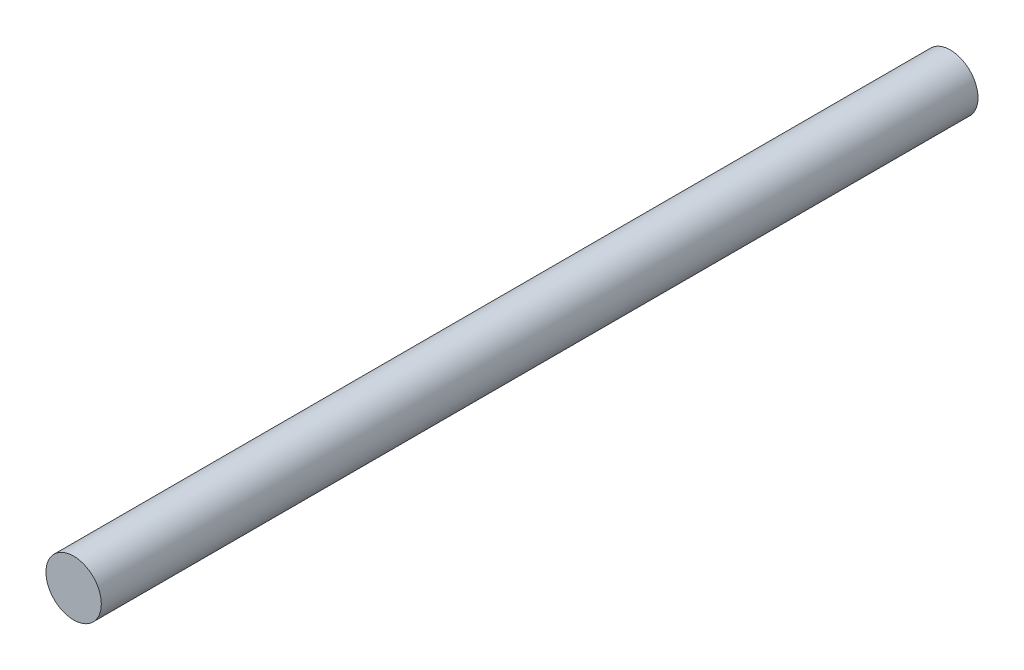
ISO-10303-21;
HEADER;
FILE_DESCRIPTION(('STEP AP214'),'2;1');
FILE_NAME('part.step','',(''),(''),'','','');
FILE_SCHEMA(('AUTOMOTIVE_DESIGN { 1 0 10303 214 1 1 1 1 }'));
ENDSEC;
DATA;
#1=APPLICATION_CONTEXT('core data for automotive mechanical design processes');
#2=APPLICATION_PROTOCOL_DEFINITION('international standard','automotive_design',2000,#1);
#3=PRODUCT_CONTEXT('',#1,'mechanical');
#4=PRODUCT('Part','Part','',(#3));
#5=PRODUCT_RELATED_PRODUCT_CATEGORY('part','',(#4));
#6=PRODUCT_DEFINITION_FORMATION('','',#4);
#7=PRODUCT_DEFINITION_CONTEXT('part definition',#1,'design');
#8=PRODUCT_DEFINITION('design','',#6,#7);
#9=PRODUCT_DEFINITION_SHAPE('','',#8);
#10=(LENGTH_UNIT() NAMED_UNIT(*) SI_UNIT(.MILLI.,.METRE.));
#11=(NAMED_UNIT(*) PLANE_ANGLE_UNIT() SI_UNIT($,.RADIAN.));
#12=(NAMED_UNIT(*) SI_UNIT($,.STERADIAN.) SOLID_ANGLE_UNIT());
#13=UNCERTAINTY_MEASURE_WITH_UNIT(LENGTH_MEASURE(1.E-05),#10,'distance_accuracy_value','');
#14=(GEOMETRIC_REPRESENTATION_CONTEXT(3) GLOBAL_UNCERTAINTY_ASSIGNED_CONTEXT((#13)) GLOBAL_UNIT_ASSIGNED_CONTEXT((#10,
#11,#12)) REPRESENTATION_CONTEXT('',''));
#15=CARTESIAN_POINT('',(0.,0.,0.));
#16=DIRECTION('',(0.,0.,1.));
#17=DIRECTION('',(1.,0.,0.));
#18=AXIS2_PLACEMENT_3D('',#15,#16,#17);
#19=CARTESIAN_POINT('',(0.,0.,95.));
#20=DIRECTION('',(0.,0.,-1.));
#21=DIRECTION('',(-1.,0.,0.));
#22=AXIS2_PLACEMENT_3D('',#19,#20,#21);
#23=CYLINDRICAL_SURFACE('',#22,3.);
#24=CARTESIAN_POINT('',(0.,0.,95.));
#25=DIRECTION('',(0.,0.,1.));
#26=DIRECTION('',(1.,0.,0.));
#27=AXIS2_PLACEMENT_3D('',#24,#25,#26);
#28=CIRCLE('',#27,3.);
#29=CARTESIAN_POINT('',(3.,0.,95.));
#30=VERTEX_POINT('',#29);
#31=EDGE_CURVE('E10',#30,#30,#28,.T.);
#32=ORIENTED_EDGE('',*,*,#31,.F.);
#33=EDGE_LOOP('',(#32));
#34=FACE_BOUND('',#33,.T.);
#35=CARTESIAN_POINT('',(0.,0.,0.));
#36=DIRECTION('',(0.,0.,1.));
#37=DIRECTION('',(1.,0.,0.));
#38=AXIS2_PLACEMENT_3D('',#35,#36,#37);
#39=CIRCLE('',#38,3.);
#40=CARTESIAN_POINT('',(3.,0.,0.));
#41=VERTEX_POINT('',#40);
#42=EDGE_CURVE('E32',#41,#41,#39,.T.);
#43=ORIENTED_EDGE('',*,*,#42,.T.);
#44=EDGE_LOOP('',(#43));
#45=FACE_BOUND('',#44,.T.);
#46=ADVANCED_FACE('F29',(#34,#45),#23,.T.);
#47=CARTESIAN_POINT('',(0.,0.,95.));
#48=DIRECTION('',(0.,0.,1.));
#49=DIRECTION('',(1.,0.,0.));
#50=AXIS2_PLACEMENT_3D('',#47,#48,#49);
#51=PLANE('',#50);
#52=ORIENTED_EDGE('',*,*,#31,.T.);
#53=EDGE_LOOP('',(#52));
#54=FACE_BOUND('',#53,.T.);
#55=ADVANCED_FACE('F44',(#54),#51,.T.);
#56=CARTESIAN_POINT('',(0.,0.,0.));
#57=DIRECTION('',(0.,0.,1.));
#58=DIRECTION('',(1.,0.,0.));
#59=AXIS2_PLACEMENT_3D('',#56,#57,#58);
#60=PLANE('',#59);
#61=ORIENTED_EDGE('',*,*,#42,.F.);
#62=EDGE_LOOP('',(#61));
#63=FACE_BOUND('',#62,.T.);
#64=ADVANCED_FACE('F42',(#63),#60,.F.);
#65=CLOSED_SHELL('',(#46,#55,#64));
#66=MANIFOLD_SOLID_BREP('B2',#65);
#67=ADVANCED_BREP_SHAPE_REPRESENTATION('',(#18,#66),#14);
#68=SHAPE_DEFINITION_REPRESENTATION(#9,#67);
ENDSEC;
END-ISO-10303-21;
